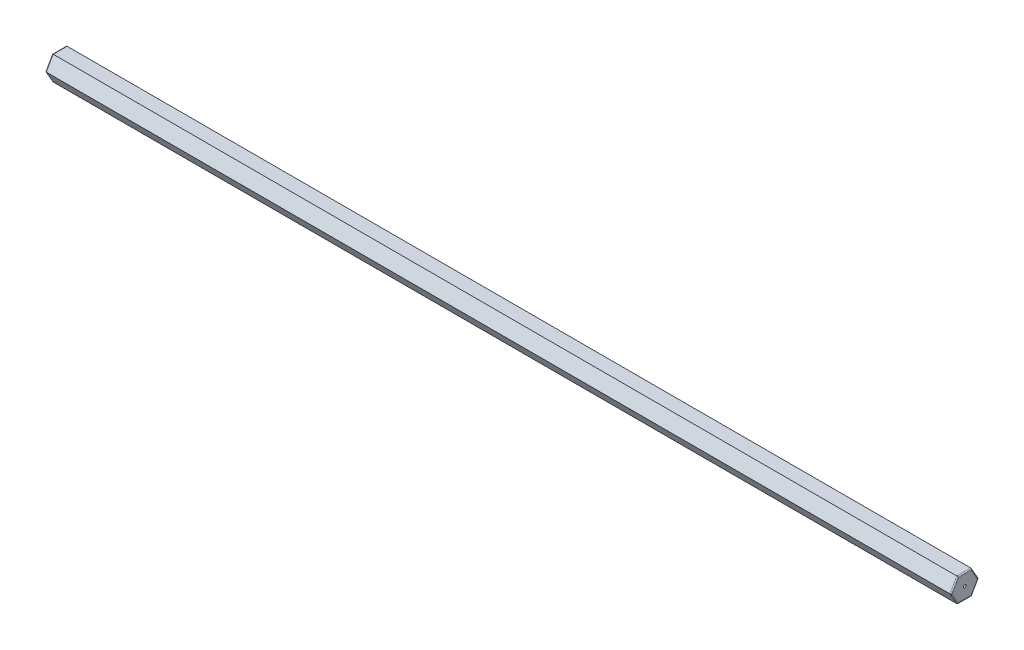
from build123d import *

# Parameters (mm, degrees)
BOSS_EXTRUDE1_DEPTH = 100.4824
FILLET1_R           = 0.127
SKETCH2_R           = 0.153628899
CUT_EXTRUDE1_DEPTH  = 0.254


with BuildPart() as part:
    # Sketch1 → Boss-Extrude1 (new body)
    with BuildSketch(Plane(origin=(0, 0, 0), x_dir=(0, 0, -1), z_dir=(1, 0, 0))):
        Polygon((1.539793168, 0), (0.769896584, 1.3335), (-0.769896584, 1.3335), (-1.539793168, 0), (-0.769896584, -1.3335), (0.769896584, -1.3335), align=None)
    extrude(amount=-BOSS_EXTRUDE1_DEPTH)

    # Fillet1
    fillet1_edges = [part.edges().sort_by_distance(p)[0] for p in [
        (-100.4824, 1.3335, 0),
        (-100.4824, 0.66675, 1.154844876),
        (-100.4824, -0.66675, 1.154844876),
        (-100.4824, -1.3335, 0),
        (-100.4824, -0.66675, -1.154844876),
        (0, -1.3335, 0),
        (0, -0.66675, 1.154844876),
        (0, 0.66675, 1.154844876),
        (-100.4824, 0.66675, -1.154844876),
        (0, 1.3335, 0),
        (0, 0.66675, -1.154844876),
        (0, -0.66675, -1.154844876),
    ]]
    fillet(fillet1_edges, radius=FILLET1_R)

    # Sketch2 → Cut-Extrude1 (cut)
    with BuildSketch(Plane(origin=(0, 0, 0), x_dir=(0, 0, -1), z_dir=(1, 0, 0))):
        Circle(SKETCH2_R)
    extrude(amount=-CUT_EXTRUDE1_DEPTH, mode=Mode.SUBTRACT)


solid = part.part
